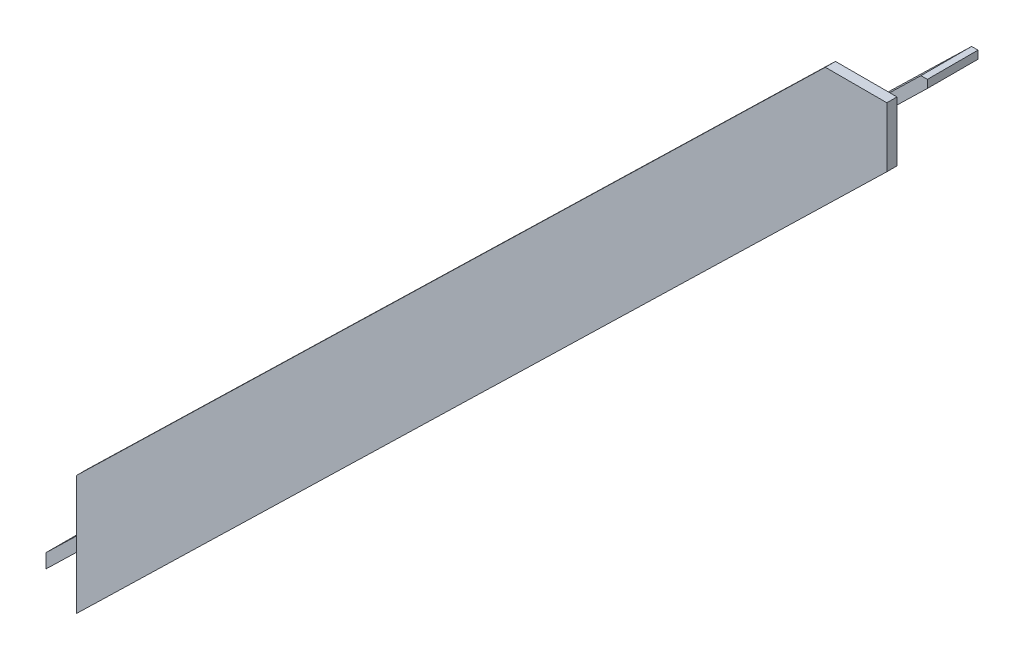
from build123d import *

# Parameters (mm, degrees)
BOSS_EXTRU_1_DEPTH = 10
BOSS_EXTRU_2_DEPTH = 50


with BuildPart() as part:
    # Esquisse3D22 → Boss.-Extru.1 (new body)
    with BuildSketch(Plane(origin=(2182.003021, -768.640995, 880.309999), x_dir=(0.7439226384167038, 0.668265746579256, 0), z_dir=(0, 0, -1))):
        Polygon((0, 0), (1030.21098705, -40.577175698), (1075.394032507, 0), (1035.936891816, 43.910675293), (-78.889434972, 87.82080618), align=None)
    extrude(amount=BOSS_EXTRU_1_DEPTH)

    # Esquisse23 → Boss.-Extru.2 (add)
    with BuildSketch(Plane(origin=(0, 0, 870.309999), x_dir=(-1, 0, 0), z_dir=(0, 0, -1))):
        Polygon((-3005.692005, -20.004001), (-3012.000084, -20.005001), (-3012.003183, -27.814999), (-2142.008066, -873.52097), (-2142.003059, -859.57998), align=None)
    extrude(amount=BOSS_EXTRU_2_DEPTH)


solid = part.part
